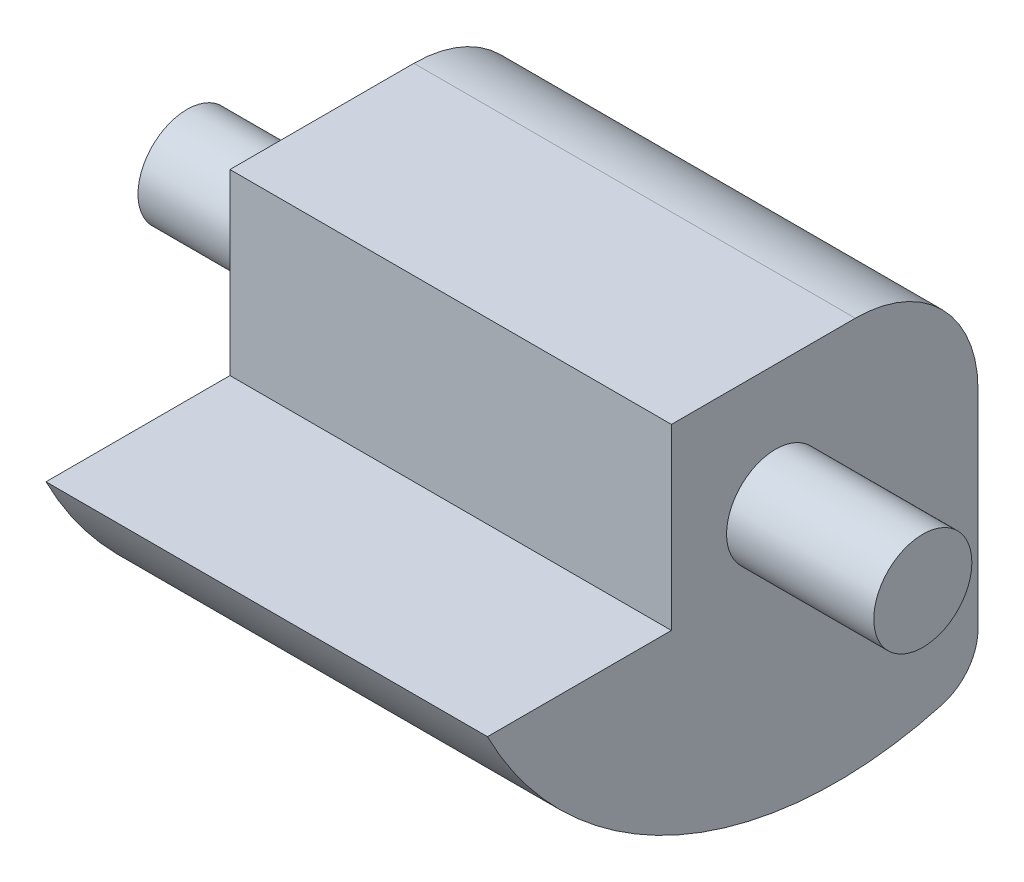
from build123d import *

# Parameters (mm, degrees)
BOSS_EXTRU_1_DEPTH      = 9
BOSS_EXTRU_1_DEPTH_BACK = 9
ESQUISSE3_R             = 2
BOSS_EXTRU_2_DEPTH      = 6
BOSS_EXTRU_3_START      = 6
ESQUISSE4_R             = 2
BOSS_EXTRU_3_DEPTH      = 6
CONG_1_R                = 5
CONG_2_R                = 2


with BuildPart() as part:
    # Esquisse2 → Boss.-Extru.1 (new, two sides: drawn at the far end of the back side and taken through both)
    with BuildSketch(Plane(origin=(10.821782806, 0, 0), x_dir=(0, 0, -1), z_dir=(1, 0, 0)).offset(-BOSS_EXTRU_1_DEPTH_BACK)):
        with BuildLine():
            Line((-86.612448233, 25.230124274), (-74.112448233, 25.230124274))
            Line((-74.112448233, 25.230124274), (-74.112448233, 10.299032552))
            ThreePointArc((-74.112448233, 10.299032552), (-85.58200339, 10.287343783), (-94.112448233, 17.954308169))
            Line((-94.112448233, 17.954308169), (-86.612448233, 17.954308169))
            Line((-86.612448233, 17.954308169), (-86.612448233, 25.230124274))
        make_face()
    extrude(amount=BOSS_EXTRU_1_DEPTH + BOSS_EXTRU_1_DEPTH_BACK)

    # Esquisse3 → Boss.-Extru.2 (add)
    with BuildSketch(Plane.ZY.offset(-1.821782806)):
        with Locations(Location((82.362448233, 20.230124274, 0), (0, 0, 180))):
            Circle(ESQUISSE3_R)
    extrude(amount=BOSS_EXTRU_2_DEPTH)

    # Esquisse4 → Boss.-Extru.3 (add)
    with BuildSketch(Plane(origin=(19.821782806, 0, 0), x_dir=(0, 0, -1), z_dir=(1, 0, 0)).offset(BOSS_EXTRU_3_START)):
        with Locations((-82.362448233, 20.230124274)):
            Circle(ESQUISSE4_R)
    extrude(amount=-BOSS_EXTRU_3_DEPTH)

    # Cong_1
    cong_1_edges = [part.edges().sort_by_distance(p)[0] for p in [
        (10.821782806, 25.230124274, 74.112448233),
    ]]
    fillet(cong_1_edges, radius=CONG_1_R)

    # Cong_2
    cong_2_edges = [part.edges().sort_by_distance(p)[0] for p in [
        (10.821782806, 10.299032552, 74.112448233),
    ]]
    fillet(cong_2_edges, radius=CONG_2_R)


solid = part.part
